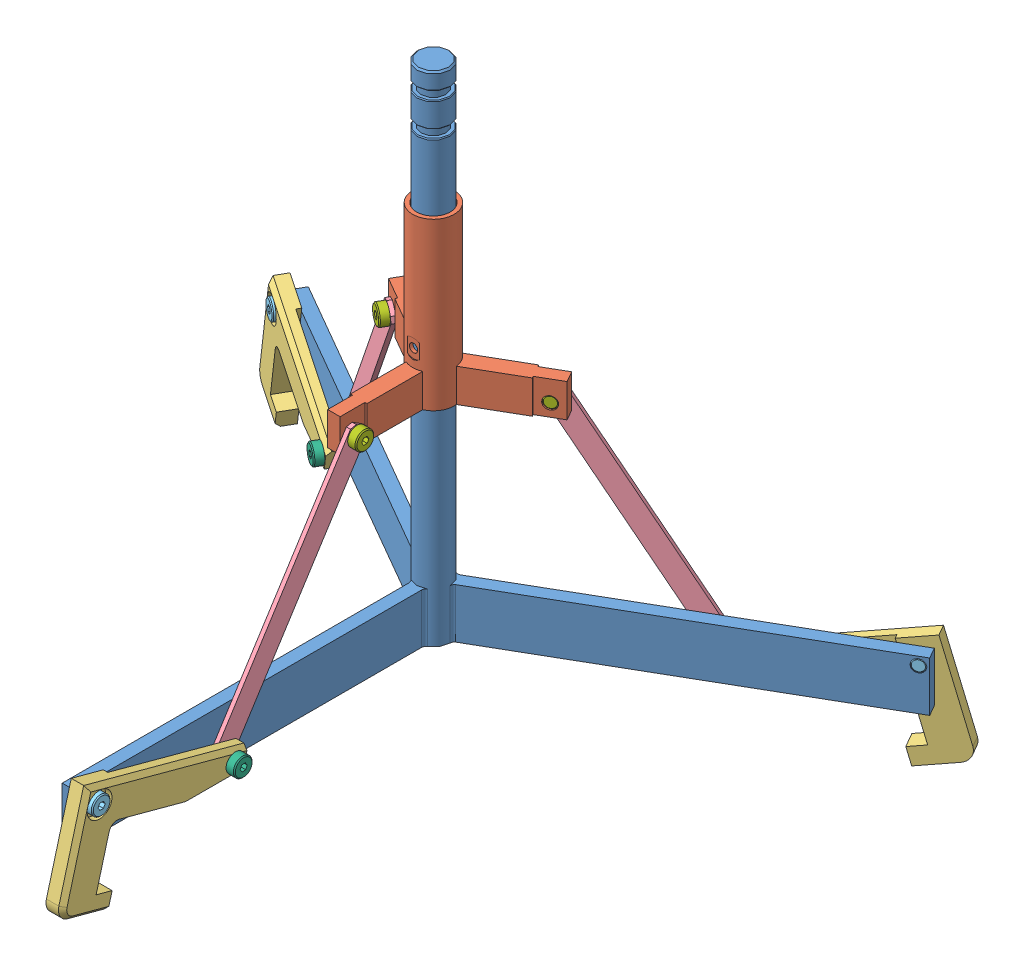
SolidWorks assembly Claw Assem.SLDASM, configuration Default (file format 4100). Lengths in mm.
Overall size (532.05 446.47 470.39).
17 component instances, 7 part files, 13 mates.
Components (placement in the parent):
- Center-Post-1: Center-Post.sldprt [Default] at origin size (488.7 381 423.22)
- Collar-1: Collar.sldprt [Default] at (0 158.75 0) size (136.74 127 118.42)
- Claw-2: Claw.sldprt [Default] at (17.4625 31.75 273.05) x (0 0.260582 0.965452) z (-1 0 0) size (127 82.55 12.7)
- Connecting-Rod-1: Connecting-Rod.sldprt [Default] at (8.1915 169.3637 56.5685) x (0 -0.843284 0.537469) z (-1 0 0) size (203.2 15.88 3.17)
- Pin-Long-1: Pin-Long.sldprt [Default] at (12.6873 31.75 273.05) x (0 -1 0) z (0 0 1) size (14.27 23.8 14.27)
- Pin-Medium-1: Pin-Medium.sldprt [Default] at (17.4625 7.6295 169.0628) x (0 0.441261 0.897379) z (0 0.897379 -0.441261) size (14.27 19.3 14.27)
- Pin-Short-1: Pin-Short.sldprt [Default] at (8.1915 168.275 66.675) x (0 -1 0) z (0 0 1) size (14.27 18.8 14.27)
- Pin-Long-2: Pin-Long.sldprt [Default] at (-242.8119 31.75 -125.5375) x (0 -1 0) z (-0.866025 0 -0.5) size (14.27 23.8 14.27)
- Pin-Medium-2: Pin-Medium.sldprt [Default] at (-155.1439 7.6295 -69.4084) x (-0.777153 0.441261 -0.448689) z (0.382143 0.897379 0.22063) size (14.27 19.3 14.27)
- Claw-5: Claw.sldprt [Default] at (-245.1995 31.75 -121.402) x (-0.836106 0.260582 -0.482726) z (0.5 0 -0.866025) size (127 82.55 12.7)
- Pin-Short-2: Pin-Short.sldprt [Default] at (-61.838 168.275 -26.2435) x (0 -1 0) z (-0.866025 0 -0.5) size (14.27 18.8 14.27)
- Connecting-Rod-4: Connecting-Rod.sldprt [Default] at (-53.0855 169.3637 -21.1902) x (-0.465462 -0.843284 -0.268734) z (0.5 0 -0.866025) size (203.2 15.88 3.17)
- Connecting-Rod-5: Connecting-Rod.sldprt [Default] at (44.894 169.3637 -35.3783) x (0.465462 -0.843284 -0.268734) z (0.5 0 0.866025) size (203.2 15.88 3.17)
- Pin-Short-3: Pin-Short.sldprt [Default] at (53.6465 168.275 -40.4315) x (0 -1 0) z (0.866025 0 -0.5) size (14.27 18.8 14.27)
- Claw-6: Claw.sldprt [Default] at (227.737 31.75 -151.648) x (0.836106 0.260582 -0.482726) z (0.5 0 0.866025) size (127 82.55 12.7)
- Pin-Medium-3: Pin-Medium.sldprt [Default] at (137.6814 7.6295 -99.6544) x (0.777153 0.441261 -0.448689) z (-0.382143 0.897379 0.22063) size (14.27 19.3 14.27)
- Pin-Long-3: Pin-Long.sldprt [Default] at (230.1246 31.75 -147.5125) x (0 -1 0) z (0.866025 0 -0.5) size (14.27 23.8 14.27)
Mates (geometry in assembly coordinates):
- Concentric11: concentric aligned: cylinder of Center-Post-1 through (0 381 0) axis (0 -1 0) radius 12.7; cylinder of Collar-1 through (0 285.75 0) axis (0 -1 0) radius 12.827
- Concentric131: concentric aligned: cylinder of Center-Post-1 through (12.7 31.75 273.05) axis (-1 0 0) radius 4.7625; cylinder of Claw-2 through (17.4625 31.75 273.05) axis (-1 0 0) radius 4.7625
- Coincident41: coincident anti-aligned: plane of Center-Post-1 through (4.7625 0 279.4) normal (1 0 0); plane of Claw-2 through (4.7625 22.7982 288.6206) normal (-1 0 0)
- Concentric141: concentric aligned: cylinder of Claw-2 through (17.4625 7.6295 169.0628) axis (-1 0 0) radius 4.7625; cylinder of Connecting-Rod-1 through (8.1915 7.6295 169.0628) axis (-1 0 0) radius 4.7625
- Coincident51: coincident anti-aligned: plane of Claw-2 through (8.1915 16.1794 264.0982) normal (-1 0 0); plane of Connecting-Rod-1 through (8.1915 169.3637 56.5685) normal (1 0 0)
- Concentric15: concentric anti-aligned: cylinder of Collar-1 through (-15.875 168.275 66.675) axis (1 0 0) radius 4.7625; cylinder of Connecting-Rod-1 through (8.1915 168.275 66.675) axis (-1 0 0) radius 4.7625
- Concentric161: concentric aligned: cylinder of Claw-2 through (17.4625 31.75 273.05) axis (-1 0 0) radius 4.7625; cylinder of Pin-Long-1 through (12.6873 31.75 273.05) axis (-1 0 0) radius 4.7371
- Coincident61: coincident anti-aligned: plane of Claw-2 through (12.6873 31.75 273.05) normal (1 0 0); plane of Pin-Long-1 through (12.6873 31.75 273.05) normal (-1 0 0)
- Concentric171: concentric aligned: cylinder of Claw-2 through (17.4625 7.6295 169.0628) axis (-1 0 0) radius 4.7625; cylinder of Pin-Medium-1 through (17.4625 7.6295 169.0628) axis (-1 0 0) radius 4.7371
- Coincident71: coincident anti-aligned: plane of Pin-Medium-1 through (17.4625 7.6295 169.0628) normal (-1 0 0); plane of Claw-2 through (17.4625 22.7982 288.6206) normal (1 0 0)
- Concentric181: concentric aligned: cylinder of Connecting-Rod-1 through (8.1915 168.275 66.675) axis (-1 0 0) radius 4.7625; cylinder of Pin-Short-1 through (8.1915 168.275 66.675) axis (-1 0 0) radius 4.7371
- Coincident91: coincident anti-aligned: plane of Connecting-Rod-1 through (8.1915 169.3637 56.5685) normal (1 0 0); plane of Pin-Short-1 through (8.1915 168.275 66.675) normal (-1 0 0)
- LimitDistance2: limit distance = 50.8 mm aligned: plane of Collar-1 through (0 285.75 0) normal (0 1 0); plane of Center-Post-1 through (0 336.55 9.525) normal (0 1 0)
